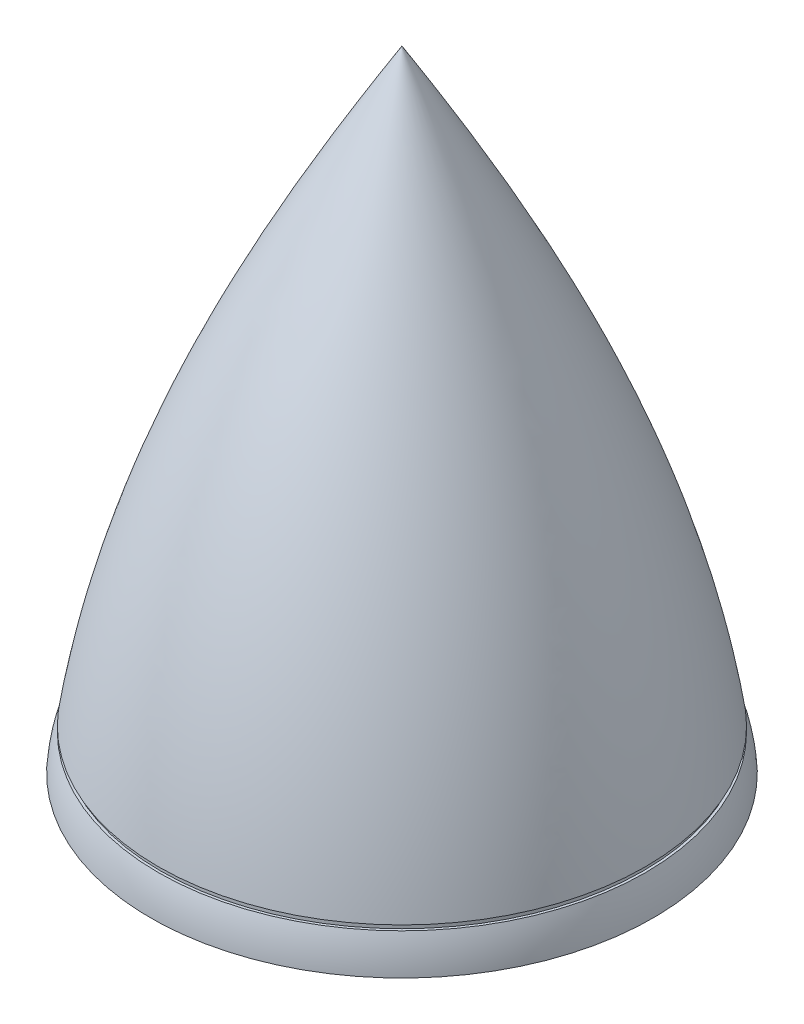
from build123d import *


with BuildPart() as part:
    # Sketch 1 → Revolve 1 (revolve)
    with BuildSketch(Plane.XY):
        with BuildLine():
            Line((0, 0), (480, 0))
            add(Edge.make_bspline(
                [(0, 1160), (214.650703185, 803.689580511), (416.533314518, 416.979658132), (480, 0)],
                knots=[0, 0, 0, 0, 1, 1, 1, 1], degree=3))
            Line((0, 1160), (0, 0))
        make_face()
    revolve(axis=Axis((0, 0, 0), (0, 1, 0)))

    # Sketch 5 → Revolve 2 (revolve)
    with BuildSketch(Plane.XY, mode=Mode.PRIVATE) as revolve_2_sk:
        with BuildLine():
            Line((-495, -80), (-490, -80))
            Line((-490, -80), (-487, -70))
            Line((-487, -70), (-460, -20))
            Line((-460, -20), (-440, -20))
            add(Edge.make_bspline(
                [(-440, -20), (-438.144580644, -53.130573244), (-424.150885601, -83)],
                knots=[0, 0, 0, 1, 1, 1], degree=2))
            Line((-424.150885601, -83), (-419.317162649, -83))
            add(Edge.make_bspline(
                [(-419.317162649, -83), (-407.346499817, -50.252566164), (-390, -20)],
                knots=[0, 0, 0, 1, 1, 1], degree=2))
            Line((-390, -20), (-375, -20))
            add(Edge.make_bspline(
                [(-375, -20), (-359.95048099, -55.270108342), (-330, -78)],
                knots=[0, 0, 0, 1, 1, 1], degree=2))
            Line((-330, -78), (-300, -78))
            Line((-300, -78), (-275, -20))
            Line((-275, -20), (-260, -20))
            add(Edge.make_bspline(
                [(-260, -20), (-240.34401373, -39.227117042), (-210, -40)],
                knots=[0, 0, 0, 1, 1, 1], degree=2))
            Line((-210, -40), (-200, -40))
            Line((-200, -40), (-200, -10))
            Line((-200, -10), (0, -10))
            Line((0, -10), (0, 0))
            Line((0, 0), (-475, 0))
            Line((-475, 0), (-475, -10))
            Line((-475, -10), (-480, -10))
            add(Edge.make_bspline(
                [(-480, -10), (-492.487851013, -43.908125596), (-495, -80)],
                knots=[0, 0, 0, 1, 1, 1], degree=2))
        make_face()
    revolve(revolve_2_sk.sketch.rotate(Axis((0, -10, 0), (0, 1, 0)), 270), axis=Axis((0, -10, 0), (0, 1, 0)))


solid = part.part
